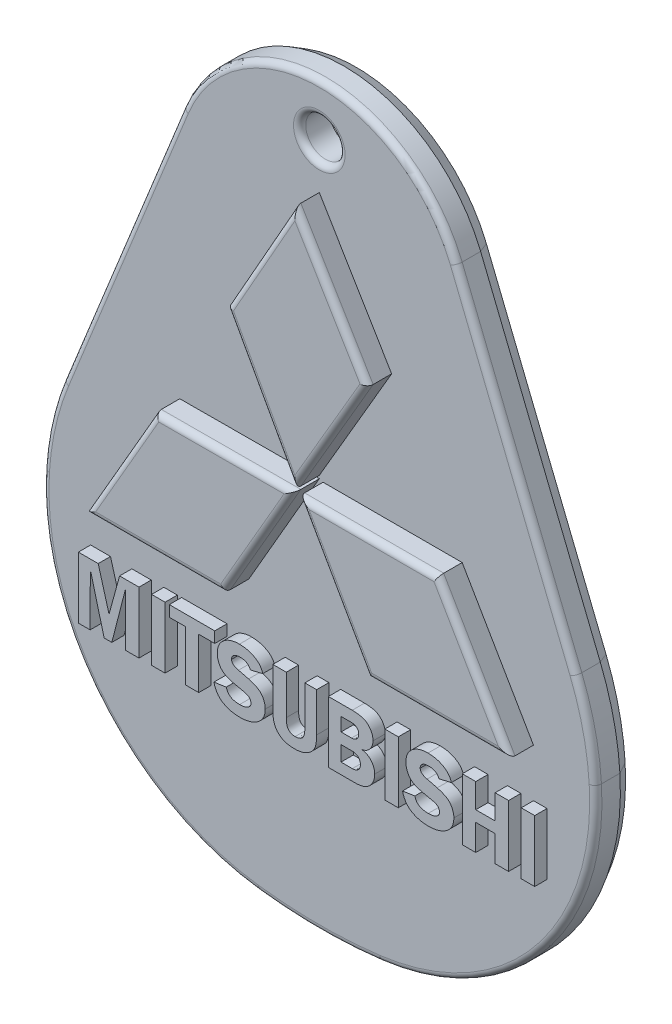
from build123d import *
from OCP.BRepFilletAPI import BRepFilletAPI_MakeChamfer

# Parameters (mm, degrees)
EXTRUDE1_DEPTH     = 3
EXTRUDE2_DEPTH     = 2
EXTRUDE3_DEPTH     = 2
EXTRUDE4_DEPTH     = 2
FILLET1_R          = 0.5
SKETCH5_W          = 1.095890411
SKETCH5_H          = 5
EXTRUDE5_DEPTH     = 1
SKETCH6_R          = 1.6
CUT_EXTRUDE1_DEPTH = 40.230474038
FILLET2_R          = 0.5
CHAMFER1_SIZE      = 1
CHAMFER1_SIZE2     = 0.577350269


with BuildPart() as part:
    # Sketch1 → Extrude1 (new body)
    with BuildSketch(Plane.XY):
        with BuildLine():
            Line((11.124297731, 24.5), (20.858058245, 0.4375))
            ThreePointArc((20.858058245, 0.4375), (21.940528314, -3.013697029), (22.456011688, -6.59375))
            ThreePointArc((22.456011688, -6.59375), (17.89980934, -20.59895727), (4.99022482, -27.6875))
            ThreePointArc((4.99022482, -27.6875), (0, -28), (-4.99022482, -27.6875))
            ThreePointArc((-4.99022482, -27.6875), (-17.89980934, -20.59895727), (-22.456011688, -6.59375))
            ThreePointArc((-22.456011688, -6.59375), (-21.940528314, -3.013697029), (-20.858058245, 0.4375))
            Line((-20.858058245, 0.4375), (-11.124297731, 24.5))
            ThreePointArc((-11.124297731, 24.5), (0, 32), (11.124297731, 24.5))
        make_face()
    extrude(amount=-EXTRUDE1_DEPTH)

    # Sketch2 → Extrude2 (add)
    with BuildSketch(Plane.XY):
        Polygon((0, 4.160131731), (-5.554990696, 14.258372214), (0, 24.088042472), (5.886100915, 14.258372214), align=None)
    extrude(amount=EXTRUDE2_DEPTH)

    # Sketch3 → Extrude3 (add)
    with BuildSketch(Plane.XY):
        Polygon((0, 3.925797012), (-5.731661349, -6.006222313), (-17.056406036, -6.006222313), (-11.34902017, 3.883731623), align=None)
    extrude(amount=EXTRUDE3_DEPTH)

    # Sketch4 → Extrude4 (add)
    with BuildSketch(Plane.XY):
        Polygon((0.305835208, 3.831755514), (11.622162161, 3.831755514), (17.421387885, -6.136643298), (5.963998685, -6.136643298), align=None)
    extrude(amount=EXTRUDE4_DEPTH)

    # Fillet1
    fillet1_edges = [part.edges().sort_by_distance(p)[0] for p in [
        (2.943050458, 9.209251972, 2),
        (2.943050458, 19.173207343, 2),
        (-2.777495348, 19.173207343, 2),
        (-2.777495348, 9.209251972, 2),
        (-11.394033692, -6.006222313, 2),
        (-2.865830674, -1.040212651, 2),
        (-5.674510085, 3.904764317, 2),
        (-14.202713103, -1.061245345, 2),
        (3.134916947, -1.152443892, 2),
        (11.692693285, -6.136643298, 2),
        (14.521775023, -1.152443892, 2),
        (5.963998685, 3.831755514, 2),
    ]]
    fillet(fillet1_edges, radius=FILLET1_R)

    # Sketch5 → Extrude5 (add)
    # profile 1 of 10: a face of its own
    with BuildSketch(Plane.XY):
        Polygon((-13.67039504, -15.04587156), (-14.766285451, -15.04587156), (-14.781268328, -10.786453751), (-15.87929915, -15.04587156), (-16.503228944, -15.04587156), (-17.629085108, -10.786453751), (-17.64299778, -15.04587156), (-18.601901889, -15.04587156), (-18.601901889, -10.04587156), (-16.986961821, -10.04587156), (-16.105112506, -13.175152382), (-15.246807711, -10.04587156), (-13.67039504, -10.04587156), align=None)
    # profile 2 of 10: a face of its own
    with BuildSketch(Plane.XY):
        with Locations((-12.095052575, -12.54587156)):
            Rectangle(SKETCH5_W, SKETCH5_H)
    # profile 3 of 10: a face of its own
    with BuildSketch(Plane.XY):
        Polygon((-8.807381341, -15.04587156), (-9.903271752, -15.04587156), (-9.903271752, -10.936282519), (-11.204641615, -10.936282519), (-11.204641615, -10.04587156), (-7.506011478, -10.04587156), (-7.506011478, -10.936282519), (-8.807381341, -10.936282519), align=None)
    # profile 4 of 10: a face of its own
    with BuildSketch(Plane.XY):
        with BuildLine():
            Line((-7.574504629, -13.689921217), (-6.568511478, -13.539022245))
            add(Edge.make_bspline(
                [(-6.568511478, -13.539022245), (-6.561052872, -13.566602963), (-6.546345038, -13.62099015), (-6.517987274, -13.699173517), (-6.481701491, -13.771308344), (-6.441853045, -13.839203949), (-6.393622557, -13.900621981), (-6.340724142, -13.957447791), (-6.280730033, -14.007675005), (-6.216829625, -14.05460686), (-6.145009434, -14.093608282), (-6.068263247, -14.12968994), (-5.984191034, -14.157473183), (-5.895571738, -14.182969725), (-5.800470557, -14.200203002), (-5.699904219, -14.214877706), (-5.592927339, -14.221563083), (-5.519714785, -14.223144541), (-5.482252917, -14.223953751)],
                knots=[0, 0, 0, 0, 0.977679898, 1.927914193, 2.839726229, 3.737951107, 4.617055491, 5.50660972, 6.389858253, 7.291065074, 8.214813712, 9.181763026, 10.189472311, 11.240972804, 12.335193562, 13.493725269, 14.717573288, 16, 16, 16, 16], degree=3))
            add(Edge.make_bspline(
                [(-5.482252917, -14.223953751), (-5.445498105, -14.223633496), (-5.374046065, -14.223010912), (-5.270382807, -14.215626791), (-5.173652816, -14.202480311), (-5.083690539, -14.186081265), (-5.001175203, -14.163365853), (-4.925411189, -14.13680912), (-4.856473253, -14.104689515), (-4.776586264, -14.05636354), (-4.692831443, -13.988178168), (-4.615925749, -13.895772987), (-4.569720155, -13.791540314), (-4.563784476, -13.718886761), (-4.560805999, -13.682429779)],
                knots=[0, 0, 0, 0, 1.118230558, 2.173861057, 3.159416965, 4.087593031, 4.953920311, 5.760743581, 6.527969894, 7.2632813, 8.597509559, 9.794320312, 10.893207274, 12, 12, 12, 12], degree=3))
            add(Edge.make_bspline(
                [(-4.560805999, -13.682429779), (-4.562159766, -13.65559334), (-4.56486215, -13.60202258), (-4.583107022, -13.522752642), (-4.616510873, -13.447666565), (-4.652253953, -13.386944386), (-4.690576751, -13.341405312), (-4.727285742, -13.30782268), (-4.772986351, -13.277473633), (-4.825036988, -13.247032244), (-4.885888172, -13.221047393), (-4.953142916, -13.195034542), (-5.028729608, -13.171700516), (-5.081939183, -13.157814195), (-5.10982141, -13.150537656)],
                knots=[0, 0, 0, 0, 1.152874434, 2.301362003, 3.468304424, 4.671892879, 5.313436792, 6.018447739, 6.800506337, 7.665255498, 8.604950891, 9.637955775, 10.762270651, 12, 12, 12, 12], degree=3))
            Line((-5.10982141, -13.150537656), (-6.041970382, -12.941847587))
            add(Edge.make_bspline(
                [(-6.041970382, -12.941847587), (-6.118579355, -12.920264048), (-6.263080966, -12.879552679), (-6.462562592, -12.80882803), (-6.630952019, -12.732222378), (-6.772307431, -12.649011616), (-6.889103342, -12.550378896), (-6.993417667, -12.43975777), (-7.083102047, -12.309561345), (-7.160085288, -12.165091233), (-7.223940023, -12.009826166), (-7.266124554, -11.846525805), (-7.296543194, -11.679059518), (-7.299191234, -11.565348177), (-7.300532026, -11.507772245)],
                knots=[0, 0, 0, 0, 1.370147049, 2.584402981, 3.639672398, 4.551868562, 5.398030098, 6.262822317, 7.162484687, 8.110513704, 9.077688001, 10.044628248, 11.009928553, 12, 12, 12, 12], degree=3))
            add(Edge.make_bspline(
                [(-7.300532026, -11.507772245), (-7.299365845, -11.451303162), (-7.297080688, -11.340650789), (-7.27112239, -11.179385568), (-7.232160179, -11.026269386), (-7.176072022, -10.881842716), (-7.103912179, -10.746023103), (-7.015690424, -10.619385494), (-6.911553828, -10.501270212), (-6.792080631, -10.393461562), (-6.661255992, -10.29513612), (-6.520049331, -10.210384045), (-6.370658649, -10.138398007), (-6.212641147, -10.079455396), (-6.046093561, -10.033515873), (-5.871127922, -10.000277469), (-5.687457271, -9.980951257), (-5.562207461, -9.978585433), (-5.498305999, -9.977378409)],
                knots=[0, 0, 0, 0, 1.020694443, 2.000072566, 2.947105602, 3.874742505, 4.795732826, 5.723100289, 6.660496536, 7.638150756, 8.629449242, 9.616726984, 10.61257384, 11.625505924, 12.663618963, 13.734437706, 14.844128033, 16, 16, 16, 16], degree=3))
            add(Edge.make_bspline(
                [(-5.498305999, -9.977378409), (-5.44262285, -9.978088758), (-5.33214861, -9.979498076), (-5.168903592, -9.994135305), (-5.009745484, -10.016047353), (-4.855474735, -10.048580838), (-4.705629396, -10.088959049), (-4.560117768, -10.13857913), (-4.418936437, -10.196966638), (-4.283911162, -10.265799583), (-4.155077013, -10.339920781), (-4.039485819, -10.426560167), (-3.935004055, -10.519456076), (-3.842738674, -10.621073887), (-3.763794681, -10.731743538), (-3.695689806, -10.850060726), (-3.640291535, -10.977074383), (-3.614807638, -11.066505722), (-3.601901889, -11.111796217)],
                knots=[0, 0, 0, 0, 1.122680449, 2.227375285, 3.302797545, 4.361020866, 5.404666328, 6.430731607, 7.459517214, 8.482652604, 9.48576164, 10.452693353, 11.390108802, 12.301857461, 13.21428708, 14.126262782, 15.051087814, 16, 16, 16, 16], degree=3))
            Line((-3.601901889, -11.111796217), (-4.601473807, -11.347241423))
            add(Edge.make_bspline(
                [(-4.601473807, -11.347241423), (-4.618713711, -11.30905892), (-4.652493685, -11.234243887), (-4.724849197, -11.135847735), (-4.810294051, -11.052496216), (-4.909756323, -10.983318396), (-5.024251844, -10.931606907), (-5.152102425, -10.894181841), (-5.293813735, -10.871568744), (-5.392981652, -10.869086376), (-5.444795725, -10.867789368)],
                knots=[0, 0, 0, 0, 0.968070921, 1.896844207, 2.808294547, 3.722735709, 4.687557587, 5.704461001, 6.800607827, 8, 8, 8, 8], degree=3))
            add(Edge.make_bspline(
                [(-5.444795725, -10.867789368), (-5.498053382, -10.869320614), (-5.598431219, -10.872206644), (-5.739227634, -10.896291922), (-5.86050807, -10.937297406), (-5.96064176, -10.996628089), (-6.039852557, -11.070191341), (-6.09650474, -11.157967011), (-6.130853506, -11.258811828), (-6.134346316, -11.330557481), (-6.136148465, -11.367575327)],
                knots=[0, 0, 0, 0, 1.326785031, 2.500669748, 3.546806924, 4.499889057, 5.3804906, 6.216602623, 7.079839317, 8, 8, 8, 8], degree=3))
            add(Edge.make_bspline(
                [(-6.136148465, -11.367575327), (-6.134721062, -11.396008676), (-6.131923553, -11.451734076), (-6.103084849, -11.530940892), (-6.058558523, -11.603367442), (-5.994187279, -11.666852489), (-5.913738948, -11.723720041), (-5.815955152, -11.773777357), (-5.700844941, -11.817833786), (-5.616662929, -11.839030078), (-5.572150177, -11.850237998)],
                knots=[0, 0, 0, 0, 0.844980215, 1.656043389, 2.48287026, 3.363291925, 4.33190483, 5.412373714, 6.631746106, 8, 8, 8, 8], degree=3))
            Line((-5.572150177, -11.850237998), (-4.753442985, -12.057857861))
            add(Edge.make_bspline(
                [(-4.753442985, -12.057857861), (-4.687938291, -12.075286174), (-4.561588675, -12.108903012), (-4.382409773, -12.169884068), (-4.220808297, -12.237488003), (-4.075128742, -12.308530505), (-3.946890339, -12.386623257), (-3.836043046, -12.471305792), (-3.74164335, -12.56129041), (-3.665013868, -12.658029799), (-3.602504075, -12.758347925), (-3.547891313, -12.859328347), (-3.49946221, -12.961193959), (-3.463154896, -13.066399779), (-3.43207046, -13.172181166), (-3.412530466, -13.280206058), (-3.398743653, -13.389550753), (-3.397199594, -13.46335009), (-3.396422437, -13.500494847)],
                knots=[0, 0, 0, 0, 1.503068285, 2.899213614, 4.193735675, 5.386163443, 6.49072822, 7.51776317, 8.474589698, 9.375374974, 10.246771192, 11.092909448, 11.921252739, 12.744593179, 13.558604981, 14.363957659, 15.176545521, 16, 16, 16, 16], degree=3))
            add(Edge.make_bspline(
                [(-3.396422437, -13.500494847), (-3.398389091, -13.560160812), (-3.402236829, -13.676896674), (-3.429017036, -13.847755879), (-3.475790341, -14.009026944), (-3.538519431, -14.162452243), (-3.62189556, -14.305678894), (-3.723733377, -14.438896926), (-3.842042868, -14.56433249), (-3.979060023, -14.677634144), (-4.12988587, -14.779839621), (-4.291855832, -14.870810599), (-4.466402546, -14.944953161), (-4.650872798, -15.007430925), (-4.846396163, -15.055488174), (-5.052553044, -15.0889372), (-5.269494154, -15.111536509), (-5.4179804, -15.113406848), (-5.494025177, -15.11436471)],
                knots=[0, 0, 0, 0, 0.965128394, 1.88826403, 2.788755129, 3.676132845, 4.563003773, 5.460957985, 6.383498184, 7.346260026, 8.330640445, 9.327793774, 10.346211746, 11.393710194, 12.475630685, 13.598915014, 14.770323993, 16, 16, 16, 16], degree=3))
            add(Edge.make_bspline(
                [(-5.494025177, -15.11436471), (-5.55577027, -15.113281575), (-5.67730312, -15.111149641), (-5.857098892, -15.095906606), (-6.03124659, -15.070593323), (-6.199558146, -15.034049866), (-6.362071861, -14.987592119), (-6.519474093, -14.932615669), (-6.670907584, -14.865571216), (-6.816347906, -14.789510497), (-6.953246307, -14.700506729), (-7.079136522, -14.597761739), (-7.191727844, -14.479930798), (-7.293555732, -14.349466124), (-7.38187133, -14.204302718), (-7.459463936, -14.045718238), (-7.524793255, -13.873283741), (-7.557687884, -13.751950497), (-7.574504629, -13.689921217)],
                knots=[0, 0, 0, 0, 1.077939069, 2.121707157, 3.147859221, 4.148362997, 5.126219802, 6.097369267, 7.05670343, 8.015127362, 8.960059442, 9.902669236, 10.845299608, 11.799606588, 12.786623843, 13.806100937, 14.87841142, 16, 16, 16, 16], degree=3))
        make_face()
    # profile 5 of 10: a face of its own
    with BuildSketch(Plane.XY):
        with BuildLine():
            Line((0.781659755, -10.04587156), (0.781659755, -13.235083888))
            add(Edge.make_bspline(
                [(0.781659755, -13.235083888), (0.781244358, -13.286458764), (0.780436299, -13.386396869), (0.774322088, -13.532082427), (0.76247703, -13.66878891), (0.746485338, -13.796974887), (0.72637409, -13.916279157), (0.702404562, -14.026970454), (0.671796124, -14.128225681), (0.637947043, -14.222381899), (0.59644305, -14.311082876), (0.546115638, -14.395843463), (0.485340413, -14.47712837), (0.41697876, -14.556843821), (0.338044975, -14.632894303), (0.250090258, -14.706418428), (0.153678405, -14.778525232), (0.048186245, -14.846399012), (-0.064314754, -14.909578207), (-0.184334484, -14.964289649), (-0.30998592, -15.011634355), (-0.442722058, -15.048458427), (-0.580457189, -15.079124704), (-0.725119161, -15.098564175), (-0.875474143, -15.112091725), (-0.978082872, -15.113599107), (-1.030198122, -15.11436471)],
                knots=[0, 0, 0, 0, 1.232909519, 2.398344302, 3.498197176, 4.525023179, 5.49755951, 6.401064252, 7.240745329, 8.0343409, 8.800303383, 9.58726796, 10.39545972, 11.233043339, 12.104842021, 13.022312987, 13.98286845, 14.992091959, 16.030663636, 17.076443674, 18.154591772, 19.249401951, 20.379492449, 21.538147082, 22.749618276, 24, 24, 24, 24], degree=3))
            add(Edge.make_bspline(
                [(-1.030198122, -15.11436471), (-1.079807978, -15.113883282), (-1.177009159, -15.112940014), (-1.319484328, -15.101586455), (-1.455739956, -15.085133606), (-1.585038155, -15.060320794), (-1.708157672, -15.029429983), (-1.824335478, -14.990990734), (-1.934364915, -14.946051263), (-2.037110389, -14.893761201), (-2.132246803, -14.83429874), (-2.221701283, -14.771253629), (-2.30426224, -14.702822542), (-2.379553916, -14.628786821), (-2.447172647, -14.548976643), (-2.50822773, -14.464659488), (-2.562013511, -14.37502422), (-2.609447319, -14.280297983), (-2.649959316, -14.179638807), (-2.684058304, -14.072467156), (-2.714005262, -13.95930865), (-2.738775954, -13.839679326), (-2.756256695, -13.713395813), (-2.770767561, -13.581409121), (-2.77763344, -13.442417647), (-2.779187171, -13.347816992), (-2.779984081, -13.299296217)],
                knots=[0, 0, 0, 0, 1.232927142, 2.415688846, 3.550816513, 4.643046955, 5.686186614, 6.704144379, 7.682352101, 8.638155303, 9.56594428, 10.468992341, 11.356891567, 12.228522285, 13.090353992, 13.954236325, 14.813509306, 15.685996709, 16.585117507, 17.50776422, 18.480004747, 19.493937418, 20.542378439, 21.648026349, 22.79367027, 24, 24, 24, 24], degree=3))
            Line((-2.779984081, -13.299296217), (-2.779984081, -10.04587156))
            Line((-2.779984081, -10.04587156), (-1.68409367, -10.04587156))
            Line((-1.68409367, -10.04587156), (-1.68409367, -13.245785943))
            add(Edge.make_bspline(
                [(-1.68409367, -13.245785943), (-1.683650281, -13.296108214), (-1.682806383, -13.391886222), (-1.671867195, -13.528388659), (-1.655096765, -13.650677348), (-1.632542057, -13.759188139), (-1.601379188, -13.853169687), (-1.564346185, -13.933586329), (-1.519769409, -14.000219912), (-1.449977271, -14.066702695), (-1.354176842, -14.129164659), (-1.231719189, -14.183021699), (-1.102438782, -14.2184495), (-1.013305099, -14.222102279), (-0.968126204, -14.223953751)],
                knots=[0, 0, 0, 0, 1.299600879, 2.473520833, 3.534320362, 4.486853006, 5.331918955, 6.08625075, 6.768716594, 7.387765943, 8.563420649, 9.70209071, 10.835266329, 12, 12, 12, 12], degree=3))
            add(Edge.make_bspline(
                [(-0.968126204, -14.223953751), (-0.910506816, -14.221533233), (-0.800428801, -14.216908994), (-0.64378357, -14.180675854), (-0.506906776, -14.117177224), (-0.405661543, -14.045705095), (-0.338197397, -13.971242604), (-0.294176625, -13.902983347), (-0.257934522, -13.822371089), (-0.228427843, -13.730013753), (-0.205249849, -13.625752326), (-0.188183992, -13.509898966), (-0.178947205, -13.381853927), (-0.177829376, -13.292532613), (-0.177244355, -13.245785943)],
                knots=[0, 0, 0, 0, 1.426096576, 2.724462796, 3.949706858, 5.144025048, 5.763171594, 6.427135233, 7.146488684, 7.9453966, 8.823982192, 9.788384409, 10.842542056, 12, 12, 12, 12], degree=3))
            Line((-0.177244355, -13.245785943), (-0.177244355, -10.04587156))
            Line((-0.177244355, -10.04587156), (0.781659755, -10.04587156))
        make_face()
    # profile 6 of 10: a face of its own
    with BuildSketch(Plane.XY):
        with BuildLine():
            Line((1.740563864, -15.04587156), (1.740563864, -10.04587156))
            Line((1.740563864, -10.04587156), (3.677635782, -10.04587156))
            add(Edge.make_bspline(
                [(3.677635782, -10.04587156), (3.758673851, -10.046770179), (3.914283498, -10.048495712), (4.138060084, -10.070824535), (4.342601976, -10.103875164), (4.500728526, -10.14418102), (4.617822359, -10.185709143), (4.700250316, -10.224673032), (4.779624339, -10.26979086), (4.856559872, -10.321147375), (4.928738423, -10.381621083), (4.99859168, -10.447671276), (5.064153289, -10.521552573), (5.126825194, -10.600889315), (5.18430492, -10.685345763), (5.233230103, -10.773975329), (5.277023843, -10.863771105), (5.310991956, -10.957555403), (5.337827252, -11.054154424), (5.357305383, -11.153585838), (5.367699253, -11.25569712), (5.369694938, -11.324389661), (5.37070085, -11.359013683)],
                knots=[0, 0, 0, 0, 2.000621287, 3.841601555, 5.547809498, 7.114173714, 7.863872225, 8.612741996, 9.362388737, 10.117451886, 10.893552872, 11.684955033, 12.489778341, 13.33049799, 14.180856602, 15.009205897, 15.82888903, 16.645583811, 17.468527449, 18.303084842, 19.144681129, 20, 20, 20, 20], degree=3))
            add(Edge.make_bspline(
                [(5.37070085, -11.359013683), (5.370013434, -11.392249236), (5.368647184, -11.458305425), (5.353575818, -11.555539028), (5.332958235, -11.650437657), (5.301457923, -11.742238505), (5.260077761, -11.830784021), (5.21247899, -11.918287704), (5.153641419, -12.001660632), (5.088467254, -12.082387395), (5.015994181, -12.1563324), (4.940067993, -12.223935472), (4.858458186, -12.280224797), (4.7734176, -12.328169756), (4.684064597, -12.365208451), (4.591176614, -12.394906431), (4.493786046, -12.413917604), (4.427206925, -12.419819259), (4.393603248, -12.422797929)],
                knots=[0, 0, 0, 0, 1.0033492, 1.994172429, 2.96688988, 3.934937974, 4.918877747, 5.917642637, 6.940203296, 7.997398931, 9.04930635, 10.065312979, 11.064019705, 12.03870592, 13.009630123, 13.981212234, 14.981081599, 16, 16, 16, 16], degree=3))
            add(Edge.make_bspline(
                [(4.393603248, -12.422797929), (4.434719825, -12.426719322), (4.51534202, -12.434408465), (4.632716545, -12.457938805), (4.743539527, -12.492796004), (4.848895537, -12.535890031), (4.946856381, -12.591707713), (5.039636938, -12.655720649), (5.125312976, -12.731230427), (5.203875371, -12.815603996), (5.275080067, -12.905841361), (5.337541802, -13.000282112), (5.389947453, -13.097817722), (5.433470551, -13.198247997), (5.466668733, -13.302261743), (5.489593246, -13.409493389), (5.505956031, -13.519616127), (5.507104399, -13.59425421), (5.507687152, -13.632130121)],
                knots=[0, 0, 0, 0, 1.091676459, 2.140580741, 3.157964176, 4.160014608, 5.144010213, 6.133146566, 7.135862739, 8.156912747, 9.177832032, 10.171993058, 11.146904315, 12.101851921, 13.062420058, 14.028253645, 14.999415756, 16, 16, 16, 16], degree=3))
            add(Edge.make_bspline(
                [(5.507687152, -13.632130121), (5.50640934, -13.679279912), (5.503882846, -13.772504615), (5.485135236, -13.9096854), (5.455593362, -14.042124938), (5.412329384, -14.169397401), (5.356189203, -14.291688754), (5.288723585, -14.409692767), (5.209028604, -14.522740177), (5.117127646, -14.62970369), (5.013005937, -14.728723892), (4.893565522, -14.813874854), (4.760862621, -14.885814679), (4.61426779, -14.944609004), (4.453908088, -14.990335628), (4.279877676, -15.023354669), (4.092231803, -15.0423861), (3.962711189, -15.044686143), (3.8959577, -15.04587156)],
                knots=[0, 0, 0, 0, 0.933798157, 1.846308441, 2.737778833, 3.618285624, 4.503769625, 5.399599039, 6.307390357, 7.239475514, 8.189393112, 9.146460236, 10.136284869, 11.173006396, 12.268950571, 13.434565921, 14.677803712, 16, 16, 16, 16], degree=3))
            Line((3.8959577, -15.04587156), (1.740563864, -15.04587156))
        make_face()
        with BuildLine():
            Line((2.767961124, -12.032172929), (3.618774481, -12.032172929))
            add(Edge.make_bspline(
                [(3.618774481, -12.032172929), (3.662494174, -12.030619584), (3.74608775, -12.027649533), (3.863626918, -11.997123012), (3.966609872, -11.947181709), (4.052295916, -11.876685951), (4.122003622, -11.791337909), (4.171392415, -11.692634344), (4.201489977, -11.582290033), (4.204665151, -11.505118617), (4.206317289, -11.464964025)],
                knots=[0, 0, 0, 0, 1.137553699, 2.175042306, 3.139849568, 4.098362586, 5.043795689, 5.991968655, 6.955161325, 8, 8, 8, 8], degree=3))
            add(Edge.make_bspline(
                [(4.206317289, -11.464964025), (4.204764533, -11.422217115), (4.201821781, -11.341204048), (4.166318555, -11.229107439), (4.109928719, -11.133939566), (4.028852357, -11.061537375), (3.935921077, -11.004961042), (3.832025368, -10.965476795), (3.720274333, -10.939751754), (3.642466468, -10.937455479), (3.602721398, -10.936282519)],
                knots=[0, 0, 0, 0, 1.127546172, 2.136902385, 3.077734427, 4.019702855, 4.981572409, 5.944183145, 6.94986727, 8, 8, 8, 8], degree=3))
            Line((3.602721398, -10.936282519), (2.767961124, -10.936282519))
            Line((2.767961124, -10.936282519), (2.767961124, -12.032172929))
        make_face(mode=Mode.SUBTRACT)
        with BuildLine():
            Line((2.767961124, -14.155460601), (3.687267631, -14.155460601))
            add(Edge.make_bspline(
                [(3.687267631, -14.155460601), (3.735963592, -14.153521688), (3.829091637, -14.149813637), (3.960280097, -14.1187617), (4.075236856, -14.066856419), (4.17118986, -13.993096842), (4.249099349, -13.901890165), (4.303701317, -13.793561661), (4.338274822, -13.670965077), (4.341581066, -13.584217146), (4.34330359, -13.539022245)],
                knots=[0, 0, 0, 0, 1.146787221, 2.19316042, 3.156412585, 4.098320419, 5.023256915, 5.959780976, 6.937064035, 8, 8, 8, 8], degree=3))
            add(Edge.make_bspline(
                [(4.34330359, -13.539022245), (4.341522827, -13.495615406), (4.338079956, -13.411694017), (4.303506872, -13.292103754), (4.247170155, -13.184880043), (4.167809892, -13.092752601), (4.071415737, -13.015899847), (3.957553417, -12.960545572), (3.828532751, -12.928056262), (3.737761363, -12.924458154), (3.690478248, -12.922583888)],
                knots=[0, 0, 0, 0, 1.029923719, 1.991221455, 2.932320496, 3.88922915, 4.861653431, 5.844236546, 6.877055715, 8, 8, 8, 8], degree=3))
            Line((3.690478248, -12.922583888), (2.767961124, -12.922583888))
            Line((2.767961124, -12.922583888), (2.767961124, -14.155460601))
        make_face(mode=Mode.SUBTRACT)
    # profile 7 of 10: a face of its own
    with BuildSketch(Plane.XY):
        with Locations((6.877550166, -12.54587156)):
            Rectangle(SKETCH5_W, SKETCH5_H)
    # profile 8 of 10: a face of its own
    with BuildSketch(Plane.XY):
        with BuildLine():
            Line((7.767961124, -13.689921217), (8.773954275, -13.539022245))
            add(Edge.make_bspline(
                [(8.773954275, -13.539022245), (8.781412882, -13.566602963), (8.796120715, -13.62099015), (8.82447848, -13.699173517), (8.860764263, -13.771308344), (8.900612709, -13.839203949), (8.948843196, -13.900621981), (9.001741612, -13.957447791), (9.061735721, -14.007675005), (9.125636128, -14.05460686), (9.19745632, -14.093608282), (9.274202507, -14.12968994), (9.35827472, -14.157473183), (9.446894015, -14.182969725), (9.541995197, -14.200203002), (9.642561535, -14.214877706), (9.749538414, -14.221563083), (9.822750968, -14.223144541), (9.860212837, -14.223953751)],
                knots=[0, 0, 0, 0, 0.977679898, 1.927914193, 2.839726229, 3.737951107, 4.617055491, 5.50660972, 6.389858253, 7.291065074, 8.214813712, 9.181763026, 10.189472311, 11.240972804, 12.335193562, 13.493725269, 14.717573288, 16, 16, 16, 16], degree=3))
            add(Edge.make_bspline(
                [(9.860212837, -14.223953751), (9.896967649, -14.223633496), (9.968419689, -14.223010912), (10.072082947, -14.215626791), (10.168812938, -14.202480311), (10.258775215, -14.186081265), (10.34129055, -14.163365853), (10.417054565, -14.13680912), (10.485992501, -14.104689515), (10.56587949, -14.05636354), (10.64963431, -13.988178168), (10.726540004, -13.895772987), (10.772745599, -13.791540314), (10.778681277, -13.718886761), (10.781659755, -13.682429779)],
                knots=[0, 0, 0, 0, 1.118230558, 2.173861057, 3.159416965, 4.087593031, 4.953920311, 5.760743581, 6.527969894, 7.2632813, 8.597509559, 9.794320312, 10.893207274, 12, 12, 12, 12], degree=3))
            add(Edge.make_bspline(
                [(10.781659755, -13.682429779), (10.780305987, -13.65559334), (10.777603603, -13.60202258), (10.759358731, -13.522752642), (10.72595488, -13.447666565), (10.6902118, -13.386944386), (10.651889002, -13.341405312), (10.615180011, -13.30782268), (10.569479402, -13.277473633), (10.517428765, -13.247032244), (10.456577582, -13.221047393), (10.389322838, -13.195034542), (10.313736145, -13.171700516), (10.26052657, -13.157814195), (10.232644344, -13.150537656)],
                knots=[0, 0, 0, 0, 1.152874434, 2.301362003, 3.468304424, 4.671892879, 5.313436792, 6.018447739, 6.800506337, 7.665255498, 8.604950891, 9.637955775, 10.762270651, 12, 12, 12, 12], degree=3))
            Line((10.232644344, -13.150537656), (9.300495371, -12.941847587))
            add(Edge.make_bspline(
                [(9.300495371, -12.941847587), (9.223886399, -12.920264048), (9.079384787, -12.879552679), (8.879903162, -12.80882803), (8.711513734, -12.732222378), (8.570158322, -12.649011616), (8.453362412, -12.550378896), (8.349048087, -12.43975777), (8.259363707, -12.309561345), (8.182380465, -12.165091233), (8.11852573, -12.009826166), (8.0763412, -11.846525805), (8.045922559, -11.679059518), (8.04327452, -11.565348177), (8.041933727, -11.507772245)],
                knots=[0, 0, 0, 0, 1.370147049, 2.584402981, 3.639672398, 4.551868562, 5.398030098, 6.262822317, 7.162484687, 8.110513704, 9.077688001, 10.044628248, 11.009928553, 12, 12, 12, 12], degree=3))
            add(Edge.make_bspline(
                [(8.041933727, -11.507772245), (8.043099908, -11.451303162), (8.045385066, -11.340650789), (8.071343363, -11.179385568), (8.110305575, -11.026269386), (8.166393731, -10.881842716), (8.238553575, -10.746023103), (8.32677533, -10.619385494), (8.430911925, -10.501270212), (8.550385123, -10.393461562), (8.681209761, -10.29513612), (8.822416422, -10.210384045), (8.971807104, -10.138398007), (9.129824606, -10.079455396), (9.296372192, -10.033515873), (9.471337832, -10.000277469), (9.655008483, -9.980951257), (9.780258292, -9.978585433), (9.844159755, -9.977378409)],
                knots=[0, 0, 0, 0, 1.020694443, 2.000072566, 2.947105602, 3.874742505, 4.795732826, 5.723100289, 6.660496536, 7.638150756, 8.629449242, 9.616726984, 10.61257384, 11.625505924, 12.663618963, 13.734437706, 14.844128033, 16, 16, 16, 16], degree=3))
            add(Edge.make_bspline(
                [(9.844159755, -9.977378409), (9.899842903, -9.978088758), (10.010317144, -9.979498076), (10.173562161, -9.994135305), (10.33272027, -10.016047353), (10.486991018, -10.048580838), (10.636836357, -10.088959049), (10.782347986, -10.13857913), (10.923529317, -10.196966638), (11.058554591, -10.265799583), (11.18738874, -10.339920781), (11.302979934, -10.426560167), (11.407461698, -10.519456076), (11.499727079, -10.621073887), (11.578671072, -10.731743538), (11.646775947, -10.850060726), (11.702174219, -10.977074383), (11.727658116, -11.066505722), (11.740563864, -11.111796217)],
                knots=[0, 0, 0, 0, 1.122680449, 2.227375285, 3.302797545, 4.361020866, 5.404666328, 6.430731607, 7.459517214, 8.482652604, 9.48576164, 10.452693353, 11.390108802, 12.301857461, 13.21428708, 14.126262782, 15.051087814, 16, 16, 16, 16], degree=3))
            Line((11.740563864, -11.111796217), (10.740991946, -11.347241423))
            add(Edge.make_bspline(
                [(10.740991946, -11.347241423), (10.723752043, -11.30905892), (10.689972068, -11.234243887), (10.617616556, -11.135847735), (10.532171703, -11.052496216), (10.43270943, -10.983318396), (10.318213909, -10.931606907), (10.190363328, -10.894181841), (10.048652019, -10.871568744), (9.949484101, -10.869086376), (9.897670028, -10.867789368)],
                knots=[0, 0, 0, 0, 0.968070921, 1.896844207, 2.808294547, 3.722735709, 4.687557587, 5.704461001, 6.800607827, 8, 8, 8, 8], degree=3))
            add(Edge.make_bspline(
                [(9.897670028, -10.867789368), (9.844412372, -10.869320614), (9.744034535, -10.872206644), (9.603238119, -10.896291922), (9.481957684, -10.937297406), (9.381823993, -10.996628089), (9.302613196, -11.070191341), (9.245961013, -11.157967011), (9.211612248, -11.258811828), (9.208119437, -11.330557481), (9.206317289, -11.367575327)],
                knots=[0, 0, 0, 0, 1.326785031, 2.500669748, 3.546806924, 4.499889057, 5.3804906, 6.216602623, 7.079839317, 8, 8, 8, 8], degree=3))
            add(Edge.make_bspline(
                [(9.206317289, -11.367575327), (9.207744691, -11.396008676), (9.210542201, -11.451734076), (9.239380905, -11.530940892), (9.283907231, -11.603367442), (9.348278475, -11.666852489), (9.428726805, -11.723720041), (9.526510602, -11.773777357), (9.641620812, -11.817833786), (9.725802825, -11.839030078), (9.770315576, -11.850237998)],
                knots=[0, 0, 0, 0, 0.844980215, 1.656043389, 2.48287026, 3.363291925, 4.33190483, 5.412373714, 6.631746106, 8, 8, 8, 8], degree=3))
            Line((9.770315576, -11.850237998), (10.589022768, -12.057857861))
            add(Edge.make_bspline(
                [(10.589022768, -12.057857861), (10.654527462, -12.075286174), (10.780877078, -12.108903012), (10.96005598, -12.169884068), (11.121657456, -12.237488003), (11.267337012, -12.308530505), (11.395575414, -12.386623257), (11.506422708, -12.471305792), (11.600822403, -12.56129041), (11.677451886, -12.658029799), (11.739961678, -12.758347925), (11.794574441, -12.859328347), (11.843003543, -12.961193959), (11.879310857, -13.066399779), (11.910395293, -13.172181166), (11.929935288, -13.280206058), (11.9437221, -13.389550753), (11.945266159, -13.46335009), (11.946043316, -13.500494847)],
                knots=[0, 0, 0, 0, 1.503068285, 2.899213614, 4.193735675, 5.386163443, 6.49072822, 7.51776317, 8.474589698, 9.375374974, 10.246771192, 11.092909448, 11.921252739, 12.744593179, 13.558604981, 14.363957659, 15.176545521, 16, 16, 16, 16], degree=3))
            add(Edge.make_bspline(
                [(11.946043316, -13.500494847), (11.944076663, -13.560160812), (11.940228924, -13.676896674), (11.913448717, -13.847755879), (11.866675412, -14.009026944), (11.803946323, -14.162452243), (11.720570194, -14.305678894), (11.618732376, -14.438896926), (11.500422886, -14.56433249), (11.363405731, -14.677634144), (11.212579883, -14.779839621), (11.050609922, -14.870810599), (10.876063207, -14.944953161), (10.691592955, -15.007430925), (10.49606959, -15.055488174), (10.289912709, -15.0889372), (10.072971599, -15.111536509), (9.924485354, -15.113406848), (9.848440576, -15.11436471)],
                knots=[0, 0, 0, 0, 0.965128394, 1.88826403, 2.788755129, 3.676132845, 4.563003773, 5.460957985, 6.383498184, 7.346260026, 8.330640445, 9.327793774, 10.346211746, 11.393710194, 12.475630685, 13.598915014, 14.770323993, 16, 16, 16, 16], degree=3))
            add(Edge.make_bspline(
                [(9.848440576, -15.11436471), (9.786695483, -15.113281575), (9.665162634, -15.111149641), (9.485366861, -15.095906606), (9.311219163, -15.070593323), (9.142907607, -15.034049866), (8.980393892, -14.987592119), (8.822991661, -14.932615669), (8.671558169, -14.865571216), (8.526117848, -14.789510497), (8.389219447, -14.700506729), (8.263329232, -14.597761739), (8.15073791, -14.479930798), (8.048910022, -14.349466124), (7.960594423, -14.204302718), (7.883001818, -14.045718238), (7.817672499, -13.873283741), (7.784777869, -13.751950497), (7.767961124, -13.689921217)],
                knots=[0, 0, 0, 0, 1.077939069, 2.121707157, 3.147859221, 4.148362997, 5.126219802, 6.097369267, 7.05670343, 8.015127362, 8.960059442, 9.902669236, 10.845299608, 11.799606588, 12.786623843, 13.806100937, 14.87841142, 16, 16, 16, 16], degree=3))
        make_face()
    # profile 9 of 10: a face of its own
    with BuildSketch(Plane.XY):
        Polygon((16.398098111, -15.04587156), (15.3022077, -15.04587156), (15.3022077, -12.922583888), (13.726865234, -12.922583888), (13.726865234, -15.04587156), (12.630974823, -15.04587156), (12.630974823, -10.04587156), (13.726865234, -10.04587156), (13.726865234, -12.032172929), (15.3022077, -12.032172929), (15.3022077, -10.04587156), (16.398098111, -10.04587156), align=None)
    # profile 10 of 10: a face of its own
    with BuildSketch(Plane.XY):
        with Locations((17.973440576, -12.54587156)):
            Rectangle(SKETCH5_W, SKETCH5_H)
    extrude(amount=EXTRUDE5_DEPTH)

    # Sketch6 → Cut-Extrude1 (cut, through all)
    with BuildSketch(Plane.XY):
        with Locations((0, 27.777740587)):
            Circle(SKETCH6_R)
    extrude(amount=-CUT_EXTRUDE1_DEPTH, mode=Mode.SUBTRACT)

    # Fillet2
    fillet2_edges = [part.edges().sort_by_distance(p)[0] for p in [
        (-1.6, 27.777740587, 0),
        (15.991177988, 12.46875, 0),
        (21.940528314, -3.013697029, 0),
        (17.89980934, -20.59895727, 0),
        (0, -28, 0),
        (-17.89980934, -20.59895727, 0),
        (-21.940528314, -3.013697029, 0),
        (-15.991177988, 12.46875, 0),
        (0, 32, 0),
    ]]
    fillet(fillet2_edges, radius=FILLET2_R)

    # Chamfer1: one chamfer whose edges measure the first distance from different faces: ONE call of the kernel's chamfer builder (chamfer() names one face for all edges)
    chamfer1_edges_1 = [part.edges().sort_by_distance(p)[0] for p in [
        (-21.940528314, -3.013697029, -3),
    ]]
    chamfer1_side_1 = [part.faces().sort_by_distance(p)[0] for p in [
        (-21.940528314, -3.013697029, -1.75),
    ]]
    chamfer1_edges_2 = [part.edges().sort_by_distance(p)[0] for p in [
        (-17.89980934, -20.59895727, -3),
        (17.89980934, -20.59895727, -3),
        (-1.6, 27.777740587, -3),
    ]]
    chamfer1_side_2 = [part.faces().sort_by_distance(p)[0] for p in [
        (0, -0.842099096, -3),
    ]]
    chamfer1_edges_3 = [part.edges().sort_by_distance(p)[0] for p in [
        (0, -28, -3),
    ]]
    chamfer1_side_3 = [part.faces().sort_by_distance(p)[0] for p in [
        (0, -28, -1.75),
    ]]
    chamfer1_edges_4 = [part.edges().sort_by_distance(p)[0] for p in [
        (21.940528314, -3.013697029, -3),
    ]]
    chamfer1_side_4 = [part.faces().sort_by_distance(p)[0] for p in [
        (21.940528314, -3.013697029, -1.75),
    ]]
    chamfer1_edges_5 = [part.edges().sort_by_distance(p)[0] for p in [
        (15.991177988, 12.46875, -3),
    ]]
    chamfer1_side_5 = [part.faces().sort_by_distance(p)[0] for p in [
        (15.991177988, 12.46875, -1.75),
    ]]
    chamfer1_edges_6 = [part.edges().sort_by_distance(p)[0] for p in [
        (0, 32, -3),
    ]]
    chamfer1_side_6 = [part.faces().sort_by_distance(p)[0] for p in [
        (0, 32, -1.75),
    ]]
    chamfer1_edges_7 = [part.edges().sort_by_distance(p)[0] for p in [
        (-15.991177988, 12.46875, -3),
    ]]
    chamfer1_side_7 = [part.faces().sort_by_distance(p)[0] for p in [
        (-15.991177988, 12.46875, -1.75),
    ]]
    chamfer1 = BRepFilletAPI_MakeChamfer(part.part.solid().wrapped)
    for e in chamfer1_edges_1:
        chamfer1.Add(CHAMFER1_SIZE, CHAMFER1_SIZE2, e.wrapped, chamfer1_side_1[0].wrapped)  # the first distance lies on this face
    for e in chamfer1_edges_2:
        chamfer1.Add(CHAMFER1_SIZE, CHAMFER1_SIZE2, e.wrapped, chamfer1_side_2[0].wrapped)  # the first distance lies on this face
    for e in chamfer1_edges_3:
        chamfer1.Add(CHAMFER1_SIZE, CHAMFER1_SIZE2, e.wrapped, chamfer1_side_3[0].wrapped)  # the first distance lies on this face
    for e in chamfer1_edges_4:
        chamfer1.Add(CHAMFER1_SIZE, CHAMFER1_SIZE2, e.wrapped, chamfer1_side_4[0].wrapped)  # the first distance lies on this face
    for e in chamfer1_edges_5:
        chamfer1.Add(CHAMFER1_SIZE, CHAMFER1_SIZE2, e.wrapped, chamfer1_side_5[0].wrapped)  # the first distance lies on this face
    for e in chamfer1_edges_6:
        chamfer1.Add(CHAMFER1_SIZE, CHAMFER1_SIZE2, e.wrapped, chamfer1_side_6[0].wrapped)  # the first distance lies on this face
    for e in chamfer1_edges_7:
        chamfer1.Add(CHAMFER1_SIZE, CHAMFER1_SIZE2, e.wrapped, chamfer1_side_7[0].wrapped)  # the first distance lies on this face
    add(Compound.cast(chamfer1.Shape()), mode=Mode.REPLACE)


solid = part.part
